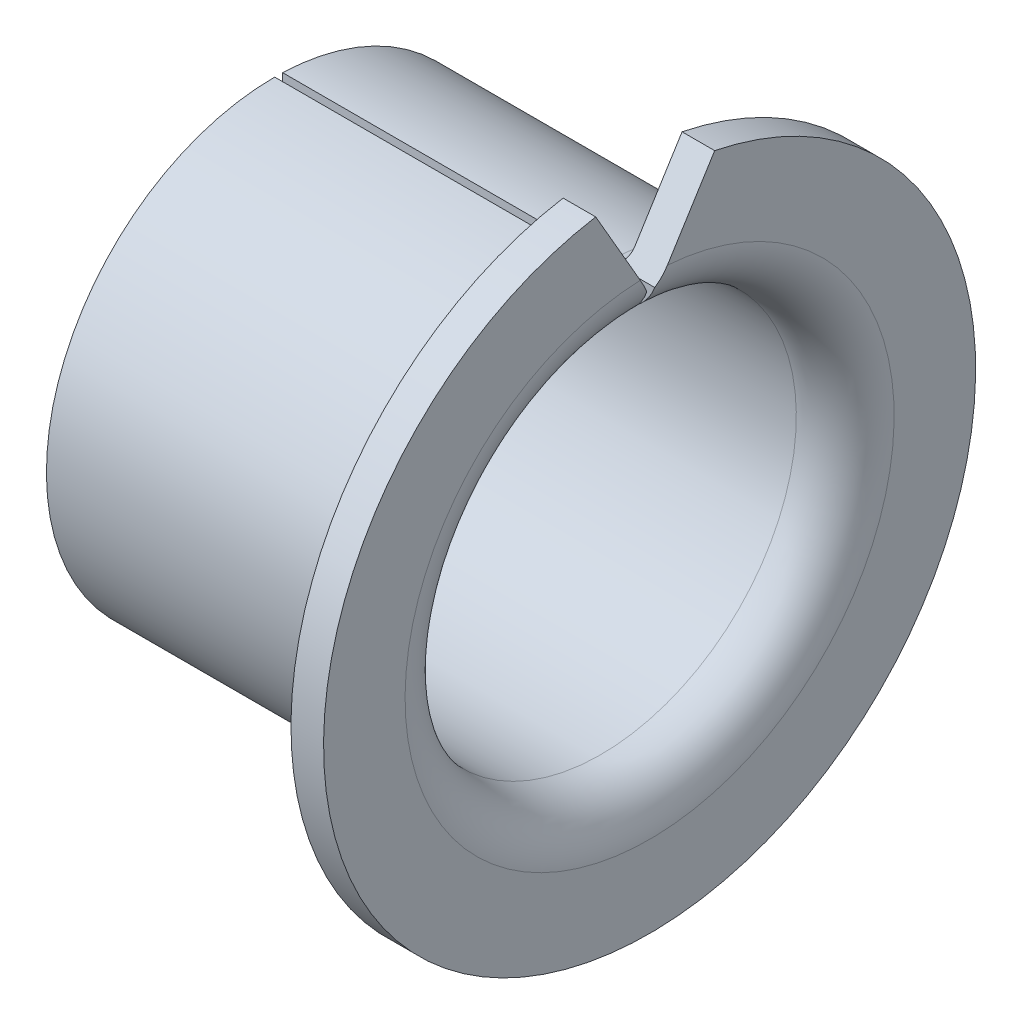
from build123d import *

# Parameters (mm, degrees)
BASE_R_VOLUTION_ANGLE   = 358
ENL_V_MAT_EXTRU_3_DEPTH = 19.227726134


with BuildPart() as part:
    # Esquisse1 → Base-R_volution (revolve)
    with BuildSketch(Plane.XY):
        with BuildLine():
            Line((0, 7), (10, 7))
            ThreePointArc((10, 7), (10.353553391, 7.146446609), (10.5, 7.5))
            Line((10.5, 7.5), (10.5, 10))
            Line((10.5, 10), (11.5, 10))
            Line((11.5, 10), (11.5, 7.5))
            ThreePointArc((11.5, 7.5), (11.060660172, 6.439339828), (10, 6))
            Line((10, 6), (0, 6))
            Line((0, 6), (0, 7))
        make_face()
    revolve(axis=Axis((0, 0, 0), (1, 0, 0)), revolution_arc=BASE_R_VOLUTION_ANGLE)

    # Esquisse2 → Enl_v. mat.-Extru.3 (cut, through all)
    with BuildSketch(Plane(origin=(0, 0, 0), x_dir=(0, 0, -1), z_dir=(1, 0, 0))):
        Polygon((0.244296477, 6.995735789), (2.079990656, 9.933460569), (0.348994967, 9.99390827), (0, 10), (-1.732050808, 10), (0, 7), align=None)
    extrude(amount=ENL_V_MAT_EXTRU_3_DEPTH, mode=Mode.SUBTRACT)


solid = part.part
